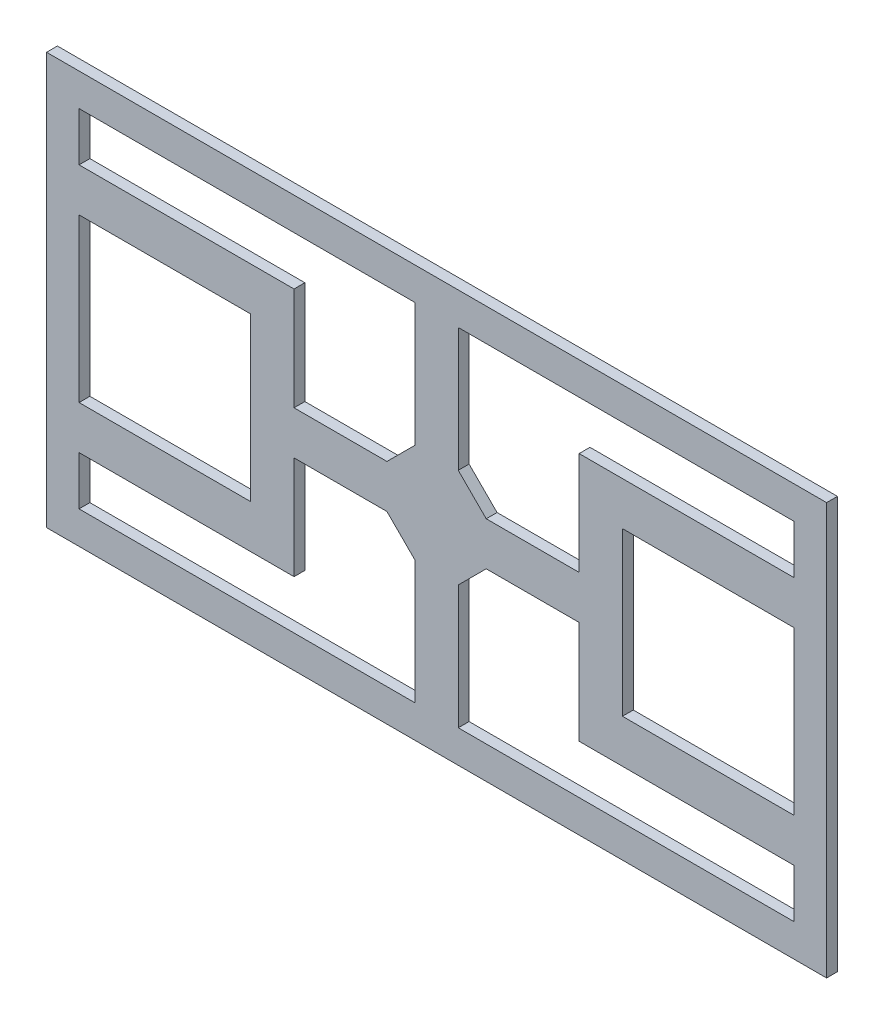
ISO-10303-21;
HEADER;
FILE_DESCRIPTION(('STEP AP214'),'2;1');
FILE_NAME('part.step','',(''),(''),'','','');
FILE_SCHEMA(('AUTOMOTIVE_DESIGN { 1 0 10303 214 1 1 1 1 }'));
ENDSEC;
DATA;
#1=APPLICATION_CONTEXT('core data for automotive mechanical design processes');
#2=APPLICATION_PROTOCOL_DEFINITION('international standard','automotive_design',2000,#1);
#3=PRODUCT_CONTEXT('',#1,'mechanical');
#4=PRODUCT('Part','Part','',(#3));
#5=PRODUCT_RELATED_PRODUCT_CATEGORY('part','',(#4));
#6=PRODUCT_DEFINITION_FORMATION('','',#4);
#7=PRODUCT_DEFINITION_CONTEXT('part definition',#1,'design');
#8=PRODUCT_DEFINITION('design','',#6,#7);
#9=PRODUCT_DEFINITION_SHAPE('','',#8);
#10=(LENGTH_UNIT() NAMED_UNIT(*) SI_UNIT(.MILLI.,.METRE.));
#11=(NAMED_UNIT(*) PLANE_ANGLE_UNIT() SI_UNIT($,.RADIAN.));
#12=(NAMED_UNIT(*) SI_UNIT($,.STERADIAN.) SOLID_ANGLE_UNIT());
#13=UNCERTAINTY_MEASURE_WITH_UNIT(LENGTH_MEASURE(1.E-05),#10,'distance_accuracy_value','');
#14=(GEOMETRIC_REPRESENTATION_CONTEXT(3) GLOBAL_UNCERTAINTY_ASSIGNED_CONTEXT((#13)) GLOBAL_UNIT_ASSIGNED_CONTEXT((#10,
#11,#12)) REPRESENTATION_CONTEXT('',''));
#15=CARTESIAN_POINT('',(0.,0.,0.));
#16=DIRECTION('',(0.,0.,1.));
#17=DIRECTION('',(1.,0.,0.));
#18=AXIS2_PLACEMENT_3D('',#15,#16,#17);
#19=CARTESIAN_POINT('',(0.,0.,12.7));
#20=DIRECTION('',(0.,0.,1.));
#21=DIRECTION('',(1.,0.,0.));
#22=AXIS2_PLACEMENT_3D('',#19,#20,#21);
#23=PLANE('',#22);
#24=DIRECTION('',(-1.,0.,0.));
#25=VECTOR('',#24,1.);
#26=CARTESIAN_POINT('',(-457.2,241.3,12.7));
#27=LINE('',#26,#25);
#28=CARTESIAN_POINT('',(457.2,241.3,12.7));
#29=VERTEX_POINT('',#28);
#30=CARTESIAN_POINT('',(-457.2,241.3,12.7));
#31=VERTEX_POINT('',#30);
#32=EDGE_CURVE('E687',#29,#31,#27,.T.);
#33=ORIENTED_EDGE('',*,*,#32,.T.);
#34=DIRECTION('',(0.,-1.,0.));
#35=VECTOR('',#34,1.);
#36=CARTESIAN_POINT('',(-457.2,-241.3,12.7));
#37=LINE('',#36,#35);
#38=CARTESIAN_POINT('',(-457.2,-241.3,12.7));
#39=VERTEX_POINT('',#38);
#40=EDGE_CURVE('E691',#31,#39,#37,.T.);
#41=ORIENTED_EDGE('',*,*,#40,.T.);
#42=DIRECTION('',(1.,0.,0.));
#43=VECTOR('',#42,1.);
#44=CARTESIAN_POINT('',(-457.2,-241.3,12.7));
#45=LINE('',#44,#43);
#46=CARTESIAN_POINT('',(457.2,-241.3,12.7));
#47=VERTEX_POINT('',#46);
#48=EDGE_CURVE('E695',#39,#47,#45,.T.);
#49=ORIENTED_EDGE('',*,*,#48,.T.);
#50=DIRECTION('',(0.,1.,0.));
#51=VECTOR('',#50,1.);
#52=CARTESIAN_POINT('',(457.2,-241.3,12.7));
#53=LINE('',#52,#51);
#54=EDGE_CURVE('E698',#47,#29,#53,.T.);
#55=ORIENTED_EDGE('',*,*,#54,.T.);
#56=EDGE_LOOP('',(#33,#41,#49,#55));
#57=FACE_BOUND('',#56,.T.);
#58=DIRECTION('',(0.,1.,0.));
#59=VECTOR('',#58,1.);
#60=CARTESIAN_POINT('',(-217.905263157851,95.25,12.7));
#61=LINE('',#60,#59);
#62=CARTESIAN_POINT('',(-217.905263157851,-95.25,12.7));
#63=VERTEX_POINT('',#62);
#64=CARTESIAN_POINT('',(-217.905263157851,95.25,12.7));
#65=VERTEX_POINT('',#64);
#66=EDGE_CURVE('E647',#63,#65,#61,.T.);
#67=ORIENTED_EDGE('',*,*,#66,.F.);
#68=DIRECTION('',(1.,0.,0.));
#69=VECTOR('',#68,1.);
#70=CARTESIAN_POINT('',(-419.099999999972,-95.25,12.7));
#71=LINE('',#70,#69);
#72=CARTESIAN_POINT('',(-419.099999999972,-95.25,12.7));
#73=VERTEX_POINT('',#72);
#74=EDGE_CURVE('E644',#73,#63,#71,.T.);
#75=ORIENTED_EDGE('',*,*,#74,.F.);
#76=DIRECTION('',(0.,-1.,0.));
#77=VECTOR('',#76,1.);
#78=CARTESIAN_POINT('',(-419.099999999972,-95.25,12.7));
#79=LINE('',#78,#77);
#80=CARTESIAN_POINT('',(-419.099999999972,95.25,12.7));
#81=VERTEX_POINT('',#80);
#82=EDGE_CURVE('E655',#81,#73,#79,.T.);
#83=ORIENTED_EDGE('',*,*,#82,.F.);
#84=DIRECTION('',(-1.,0.,0.));
#85=VECTOR('',#84,1.);
#86=CARTESIAN_POINT('',(-419.099999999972,95.25,12.7));
#87=LINE('',#86,#85);
#88=EDGE_CURVE('E651',#65,#81,#87,.T.);
#89=ORIENTED_EDGE('',*,*,#88,.F.);
#90=EDGE_LOOP('',(#67,#75,#83,#89));
#91=FACE_BOUND('',#90,.T.);
#92=DIRECTION('',(1.,0.,0.));
#93=VECTOR('',#92,1.);
#94=CARTESIAN_POINT('',(-419.099999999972,146.05,12.7));
#95=LINE('',#94,#93);
#96=CARTESIAN_POINT('',(-419.099999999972,146.05,12.7));
#97=VERTEX_POINT('',#96);
#98=CARTESIAN_POINT('',(-167.105263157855,146.05,12.7));
#99=VERTEX_POINT('',#98);
#100=EDGE_CURVE('E574',#97,#99,#95,.T.);
#101=ORIENTED_EDGE('',*,*,#100,.F.);
#102=DIRECTION('',(4.94403779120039E-13,-1.,0.));
#103=VECTOR('',#102,1.);
#104=CARTESIAN_POINT('',(-419.099999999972,146.05,12.7));
#105=LINE('',#104,#103);
#106=CARTESIAN_POINT('',(-419.1,203.2,12.7));
#107=VERTEX_POINT('',#106);
#108=EDGE_CURVE('E571',#107,#97,#105,.T.);
#109=ORIENTED_EDGE('',*,*,#108,.F.);
#110=DIRECTION('',(-1.,0.,0.));
#111=VECTOR('',#110,1.);
#112=CARTESIAN_POINT('',(-419.1,203.2,12.7));
#113=LINE('',#112,#111);
#114=CARTESIAN_POINT('',(-25.4,203.2,12.7));
#115=VERTEX_POINT('',#114);
#116=EDGE_CURVE('E591',#115,#107,#113,.T.);
#117=ORIENTED_EDGE('',*,*,#116,.F.);
#118=DIRECTION('',(0.,1.,0.));
#119=VECTOR('',#118,1.);
#120=CARTESIAN_POINT('',(-25.4,203.2,12.7));
#121=LINE('',#120,#119);
#122=CARTESIAN_POINT('',(-25.4,58.1987113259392,12.7));
#123=VERTEX_POINT('',#122);
#124=EDGE_CURVE('E587',#123,#115,#121,.T.);
#125=ORIENTED_EDGE('',*,*,#124,.F.);
#126=DIRECTION('',(0.707106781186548,0.707106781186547,0.));
#127=VECTOR('',#126,1.);
#128=CARTESIAN_POINT('',(-58.1987113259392,25.4,12.7));
#129=LINE('',#128,#127);
#130=CARTESIAN_POINT('',(-58.1987113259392,25.4,12.7));
#131=VERTEX_POINT('',#130);
#132=EDGE_CURVE('E584',#131,#123,#129,.T.);
#133=ORIENTED_EDGE('',*,*,#132,.F.);
#134=DIRECTION('',(1.,0.,0.));
#135=VECTOR('',#134,1.);
#136=CARTESIAN_POINT('',(-167.105263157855,25.4,12.7));
#137=LINE('',#136,#135);
#138=CARTESIAN_POINT('',(-167.105263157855,25.4,12.7));
#139=VERTEX_POINT('',#138);
#140=EDGE_CURVE('E581',#139,#131,#137,.T.);
#141=ORIENTED_EDGE('',*,*,#140,.F.);
#142=DIRECTION('',(0.,-1.,0.));
#143=VECTOR('',#142,1.);
#144=CARTESIAN_POINT('',(-167.105263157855,146.05,12.7));
#145=LINE('',#144,#143);
#146=EDGE_CURVE('E578',#99,#139,#145,.T.);
#147=ORIENTED_EDGE('',*,*,#146,.F.);
#148=EDGE_LOOP('',(#101,#109,#117,#125,#133,#141,#147));
#149=FACE_BOUND('',#148,.T.);
#150=DIRECTION('',(-4.94403779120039E-13,-1.,0.));
#151=VECTOR('',#150,1.);
#152=CARTESIAN_POINT('',(-419.099999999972,-146.05,12.7));
#153=LINE('',#152,#151);
#154=CARTESIAN_POINT('',(-419.099999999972,-146.05,12.7));
#155=VERTEX_POINT('',#154);
#156=CARTESIAN_POINT('',(-419.1,-203.2,12.7));
#157=VERTEX_POINT('',#156);
#158=EDGE_CURVE('E501',#155,#157,#153,.T.);
#159=ORIENTED_EDGE('',*,*,#158,.F.);
#160=DIRECTION('',(-1.,0.,0.));
#161=VECTOR('',#160,1.);
#162=CARTESIAN_POINT('',(-419.099999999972,-146.05,12.7));
#163=LINE('',#162,#161);
#164=CARTESIAN_POINT('',(-167.105263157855,-146.05,12.7));
#165=VERTEX_POINT('',#164);
#166=EDGE_CURVE('E498',#165,#155,#163,.T.);
#167=ORIENTED_EDGE('',*,*,#166,.F.);
#168=DIRECTION('',(0.,-1.,0.));
#169=VECTOR('',#168,1.);
#170=CARTESIAN_POINT('',(-167.105263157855,-146.05,12.7));
#171=LINE('',#170,#169);
#172=CARTESIAN_POINT('',(-167.105263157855,-25.4,12.7));
#173=VERTEX_POINT('',#172);
#174=EDGE_CURVE('E518',#173,#165,#171,.T.);
#175=ORIENTED_EDGE('',*,*,#174,.F.);
#176=DIRECTION('',(-1.,0.,0.));
#177=VECTOR('',#176,1.);
#178=CARTESIAN_POINT('',(-167.105263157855,-25.4,12.7));
#179=LINE('',#178,#177);
#180=CARTESIAN_POINT('',(-58.1987113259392,-25.4,12.7));
#181=VERTEX_POINT('',#180);
#182=EDGE_CURVE('E514',#181,#173,#179,.T.);
#183=ORIENTED_EDGE('',*,*,#182,.F.);
#184=DIRECTION('',(-0.707106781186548,0.707106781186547,0.));
#185=VECTOR('',#184,1.);
#186=CARTESIAN_POINT('',(-58.1987113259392,-25.4,12.7));
#187=LINE('',#186,#185);
#188=CARTESIAN_POINT('',(-25.4,-58.1987113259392,12.7));
#189=VERTEX_POINT('',#188);
#190=EDGE_CURVE('E511',#189,#181,#187,.T.);
#191=ORIENTED_EDGE('',*,*,#190,.F.);
#192=DIRECTION('',(0.,1.,0.));
#193=VECTOR('',#192,1.);
#194=CARTESIAN_POINT('',(-25.4,-203.2,12.7));
#195=LINE('',#194,#193);
#196=CARTESIAN_POINT('',(-25.4,-203.2,12.7));
#197=VERTEX_POINT('',#196);
#198=EDGE_CURVE('E508',#197,#189,#195,.T.);
#199=ORIENTED_EDGE('',*,*,#198,.F.);
#200=DIRECTION('',(1.,0.,0.));
#201=VECTOR('',#200,1.);
#202=CARTESIAN_POINT('',(-419.1,-203.2,12.7));
#203=LINE('',#202,#201);
#204=EDGE_CURVE('E505',#157,#197,#203,.T.);
#205=ORIENTED_EDGE('',*,*,#204,.F.);
#206=EDGE_LOOP('',(#159,#167,#175,#183,#191,#199,#205));
#207=FACE_BOUND('',#206,.T.);
#208=DIRECTION('',(4.94403779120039E-13,1.,0.));
#209=VECTOR('',#208,1.);
#210=CARTESIAN_POINT('',(419.099999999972,146.05,12.7));
#211=LINE('',#210,#209);
#212=CARTESIAN_POINT('',(419.099999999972,146.05,12.7));
#213=VERTEX_POINT('',#212);
#214=CARTESIAN_POINT('',(419.1,203.2,12.7));
#215=VERTEX_POINT('',#214);
#216=EDGE_CURVE('E428',#213,#215,#211,.T.);
#217=ORIENTED_EDGE('',*,*,#216,.F.);
#218=DIRECTION('',(1.,0.,0.));
#219=VECTOR('',#218,1.);
#220=CARTESIAN_POINT('',(419.099999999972,146.05,12.7));
#221=LINE('',#220,#219);
#222=CARTESIAN_POINT('',(167.105263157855,146.05,12.7));
#223=VERTEX_POINT('',#222);
#224=EDGE_CURVE('E425',#223,#213,#221,.T.);
#225=ORIENTED_EDGE('',*,*,#224,.F.);
#226=DIRECTION('',(0.,1.,0.));
#227=VECTOR('',#226,1.);
#228=CARTESIAN_POINT('',(167.105263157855,146.05,12.7));
#229=LINE('',#228,#227);
#230=CARTESIAN_POINT('',(167.105263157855,25.4,12.7));
#231=VERTEX_POINT('',#230);
#232=EDGE_CURVE('E445',#231,#223,#229,.T.);
#233=ORIENTED_EDGE('',*,*,#232,.F.);
#234=DIRECTION('',(1.,0.,0.));
#235=VECTOR('',#234,1.);
#236=CARTESIAN_POINT('',(167.105263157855,25.4,12.7));
#237=LINE('',#236,#235);
#238=CARTESIAN_POINT('',(58.1987113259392,25.4,12.7));
#239=VERTEX_POINT('',#238);
#240=EDGE_CURVE('E441',#239,#231,#237,.T.);
#241=ORIENTED_EDGE('',*,*,#240,.F.);
#242=DIRECTION('',(0.707106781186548,-0.707106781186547,0.));
#243=VECTOR('',#242,1.);
#244=CARTESIAN_POINT('',(58.1987113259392,25.4,12.7));
#245=LINE('',#244,#243);
#246=CARTESIAN_POINT('',(25.4,58.1987113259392,12.7));
#247=VERTEX_POINT('',#246);
#248=EDGE_CURVE('E438',#247,#239,#245,.T.);
#249=ORIENTED_EDGE('',*,*,#248,.F.);
#250=DIRECTION('',(0.,-1.,0.));
#251=VECTOR('',#250,1.);
#252=CARTESIAN_POINT('',(25.4,203.2,12.7));
#253=LINE('',#252,#251);
#254=CARTESIAN_POINT('',(25.4,203.2,12.7));
#255=VERTEX_POINT('',#254);
#256=EDGE_CURVE('E435',#255,#247,#253,.T.);
#257=ORIENTED_EDGE('',*,*,#256,.F.);
#258=DIRECTION('',(-1.,0.,0.));
#259=VECTOR('',#258,1.);
#260=CARTESIAN_POINT('',(419.1,203.2,12.7));
#261=LINE('',#260,#259);
#262=EDGE_CURVE('E432',#215,#255,#261,.T.);
#263=ORIENTED_EDGE('',*,*,#262,.F.);
#264=EDGE_LOOP('',(#217,#225,#233,#241,#249,#257,#263));
#265=FACE_BOUND('',#264,.T.);
#266=DIRECTION('',(0.,-1.,0.));
#267=VECTOR('',#266,1.);
#268=CARTESIAN_POINT('',(217.905263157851,95.25,12.7));
#269=LINE('',#268,#267);
#270=CARTESIAN_POINT('',(217.905263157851,95.25,12.7));
#271=VERTEX_POINT('',#270);
#272=CARTESIAN_POINT('',(217.905263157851,-95.25,12.7));
#273=VERTEX_POINT('',#272);
#274=EDGE_CURVE('E385',#271,#273,#269,.T.);
#275=ORIENTED_EDGE('',*,*,#274,.F.);
#276=DIRECTION('',(-1.,0.,0.));
#277=VECTOR('',#276,1.);
#278=CARTESIAN_POINT('',(419.099999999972,95.2499999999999,12.7));
#279=LINE('',#278,#277);
#280=CARTESIAN_POINT('',(419.099999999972,95.2499999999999,12.7));
#281=VERTEX_POINT('',#280);
#282=EDGE_CURVE('E382',#281,#271,#279,.T.);
#283=ORIENTED_EDGE('',*,*,#282,.F.);
#284=DIRECTION('',(0.,1.,0.));
#285=VECTOR('',#284,1.);
#286=CARTESIAN_POINT('',(419.099999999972,-95.2499999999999,12.7));
#287=LINE('',#286,#285);
#288=CARTESIAN_POINT('',(419.099999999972,-95.2499999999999,12.7));
#289=VERTEX_POINT('',#288);
#290=EDGE_CURVE('E393',#289,#281,#287,.T.);
#291=ORIENTED_EDGE('',*,*,#290,.F.);
#292=DIRECTION('',(1.,0.,0.));
#293=VECTOR('',#292,1.);
#294=CARTESIAN_POINT('',(419.099999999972,-95.2499999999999,12.7));
#295=LINE('',#294,#293);
#296=EDGE_CURVE('E389',#273,#289,#295,.T.);
#297=ORIENTED_EDGE('',*,*,#296,.F.);
#298=EDGE_LOOP('',(#275,#283,#291,#297));
#299=FACE_BOUND('',#298,.T.);
#300=DIRECTION('',(-4.94403779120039E-13,1.,0.));
#301=VECTOR('',#300,1.);
#302=CARTESIAN_POINT('',(419.099999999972,-146.05,12.7));
#303=LINE('',#302,#301);
#304=CARTESIAN_POINT('',(419.1,-203.2,12.7));
#305=VERTEX_POINT('',#304);
#306=CARTESIAN_POINT('',(419.099999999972,-146.05,12.7));
#307=VERTEX_POINT('',#306);
#308=EDGE_CURVE('E312',#305,#307,#303,.T.);
#309=ORIENTED_EDGE('',*,*,#308,.F.);
#310=DIRECTION('',(1.,0.,0.));
#311=VECTOR('',#310,1.);
#312=CARTESIAN_POINT('',(419.1,-203.2,12.7));
#313=LINE('',#312,#311);
#314=CARTESIAN_POINT('',(25.4,-203.2,12.7));
#315=VERTEX_POINT('',#314);
#316=EDGE_CURVE('E303',#315,#305,#313,.T.);
#317=ORIENTED_EDGE('',*,*,#316,.F.);
#318=DIRECTION('',(0.,-1.,0.));
#319=VECTOR('',#318,1.);
#320=CARTESIAN_POINT('',(25.4,-203.2,12.7));
#321=LINE('',#320,#319);
#322=CARTESIAN_POINT('',(25.4,-58.1987113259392,12.7));
#323=VERTEX_POINT('',#322);
#324=EDGE_CURVE('E341',#323,#315,#321,.T.);
#325=ORIENTED_EDGE('',*,*,#324,.F.);
#326=DIRECTION('',(-0.707106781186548,-0.707106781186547,0.));
#327=VECTOR('',#326,1.);
#328=CARTESIAN_POINT('',(58.1987113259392,-25.4,12.7));
#329=LINE('',#328,#327);
#330=CARTESIAN_POINT('',(58.1987113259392,-25.4,12.7));
#331=VERTEX_POINT('',#330);
#332=EDGE_CURVE('E338',#331,#323,#329,.T.);
#333=ORIENTED_EDGE('',*,*,#332,.F.);
#334=DIRECTION('',(-1.,0.,0.));
#335=VECTOR('',#334,1.);
#336=CARTESIAN_POINT('',(167.105263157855,-25.4,12.7));
#337=LINE('',#336,#335);
#338=CARTESIAN_POINT('',(167.105263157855,-25.4,12.7));
#339=VERTEX_POINT('',#338);
#340=EDGE_CURVE('E335',#339,#331,#337,.T.);
#341=ORIENTED_EDGE('',*,*,#340,.F.);
#342=DIRECTION('',(0.,1.,0.));
#343=VECTOR('',#342,1.);
#344=CARTESIAN_POINT('',(167.105263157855,-146.05,12.7));
#345=LINE('',#344,#343);
#346=CARTESIAN_POINT('',(167.105263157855,-146.05,12.7));
#347=VERTEX_POINT('',#346);
#348=EDGE_CURVE('E330',#347,#339,#345,.T.);
#349=ORIENTED_EDGE('',*,*,#348,.F.);
#350=DIRECTION('',(-1.,0.,0.));
#351=VECTOR('',#350,1.);
#352=CARTESIAN_POINT('',(419.099999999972,-146.05,12.7));
#353=LINE('',#352,#351);
#354=EDGE_CURVE('E326',#307,#347,#353,.T.);
#355=ORIENTED_EDGE('',*,*,#354,.F.);
#356=EDGE_LOOP('',(#309,#317,#325,#333,#341,#349,#355));
#357=FACE_BOUND('',#356,.T.);
#358=ADVANCED_FACE('F45',(#57,#91,#149,#207,#265,#299,#357),#23,.T.);
#359=CARTESIAN_POINT('',(0.,0.,0.));
#360=DIRECTION('',(0.,0.,1.));
#361=DIRECTION('',(1.,0.,0.));
#362=AXIS2_PLACEMENT_3D('',#359,#360,#361);
#363=PLANE('',#362);
#364=DIRECTION('',(-1.,0.,0.));
#365=VECTOR('',#364,1.);
#366=CARTESIAN_POINT('',(419.099999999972,95.2499999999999,0.));
#367=LINE('',#366,#365);
#368=CARTESIAN_POINT('',(419.099999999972,95.2499999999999,0.));
#369=VERTEX_POINT('',#368);
#370=CARTESIAN_POINT('',(217.905263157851,95.25,0.));
#371=VERTEX_POINT('',#370);
#372=EDGE_CURVE('E321',#369,#371,#367,.T.);
#373=ORIENTED_EDGE('',*,*,#372,.T.);
#374=DIRECTION('',(0.,-1.,0.));
#375=VECTOR('',#374,1.);
#376=CARTESIAN_POINT('',(217.905263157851,95.25,0.));
#377=LINE('',#376,#375);
#378=CARTESIAN_POINT('',(217.905263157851,-95.25,0.));
#379=VERTEX_POINT('',#378);
#380=EDGE_CURVE('E400',#371,#379,#377,.T.);
#381=ORIENTED_EDGE('',*,*,#380,.T.);
#382=DIRECTION('',(1.,0.,0.));
#383=VECTOR('',#382,1.);
#384=CARTESIAN_POINT('',(419.099999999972,-95.2499999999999,0.));
#385=LINE('',#384,#383);
#386=CARTESIAN_POINT('',(419.099999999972,-95.2499999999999,0.));
#387=VERTEX_POINT('',#386);
#388=EDGE_CURVE('E404',#379,#387,#385,.T.);
#389=ORIENTED_EDGE('',*,*,#388,.T.);
#390=DIRECTION('',(0.,1.,0.));
#391=VECTOR('',#390,1.);
#392=CARTESIAN_POINT('',(419.099999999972,-95.2499999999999,0.));
#393=LINE('',#392,#391);
#394=EDGE_CURVE('E386',#387,#369,#393,.T.);
#395=ORIENTED_EDGE('',*,*,#394,.T.);
#396=EDGE_LOOP('',(#373,#381,#389,#395));
#397=FACE_BOUND('',#396,.T.);
#398=DIRECTION('',(-1.,0.,0.));
#399=VECTOR('',#398,1.);
#400=CARTESIAN_POINT('',(-419.099999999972,-146.05,0.));
#401=LINE('',#400,#399);
#402=CARTESIAN_POINT('',(-167.105263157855,-146.05,0.));
#403=VERTEX_POINT('',#402);
#404=CARTESIAN_POINT('',(-419.099999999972,-146.05,0.));
#405=VERTEX_POINT('',#404);
#406=EDGE_CURVE('E497',#403,#405,#401,.T.);
#407=ORIENTED_EDGE('',*,*,#406,.T.);
#408=DIRECTION('',(-4.94403779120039E-13,-1.,0.));
#409=VECTOR('',#408,1.);
#410=CARTESIAN_POINT('',(-419.099999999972,-146.05,0.));
#411=LINE('',#410,#409);
#412=CARTESIAN_POINT('',(-419.1,-203.2,0.));
#413=VERTEX_POINT('',#412);
#414=EDGE_CURVE('E525',#405,#413,#411,.T.);
#415=ORIENTED_EDGE('',*,*,#414,.T.);
#416=DIRECTION('',(1.,0.,0.));
#417=VECTOR('',#416,1.);
#418=CARTESIAN_POINT('',(-419.1,-203.2,0.));
#419=LINE('',#418,#417);
#420=CARTESIAN_POINT('',(-25.4,-203.2,0.));
#421=VERTEX_POINT('',#420);
#422=EDGE_CURVE('E529',#413,#421,#419,.T.);
#423=ORIENTED_EDGE('',*,*,#422,.T.);
#424=DIRECTION('',(0.,1.,0.));
#425=VECTOR('',#424,1.);
#426=CARTESIAN_POINT('',(-25.4,-203.2,0.));
#427=LINE('',#426,#425);
#428=CARTESIAN_POINT('',(-25.4,-58.1987113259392,0.));
#429=VERTEX_POINT('',#428);
#430=EDGE_CURVE('E533',#421,#429,#427,.T.);
#431=ORIENTED_EDGE('',*,*,#430,.T.);
#432=DIRECTION('',(-0.707106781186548,0.707106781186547,0.));
#433=VECTOR('',#432,1.);
#434=CARTESIAN_POINT('',(-58.1987113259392,-25.4,0.));
#435=LINE('',#434,#433);
#436=CARTESIAN_POINT('',(-58.1987113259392,-25.4,0.));
#437=VERTEX_POINT('',#436);
#438=EDGE_CURVE('E537',#429,#437,#435,.T.);
#439=ORIENTED_EDGE('',*,*,#438,.T.);
#440=DIRECTION('',(-1.,0.,0.));
#441=VECTOR('',#440,1.);
#442=CARTESIAN_POINT('',(-167.105263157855,-25.4,0.));
#443=LINE('',#442,#441);
#444=CARTESIAN_POINT('',(-167.105263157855,-25.4,0.));
#445=VERTEX_POINT('',#444);
#446=EDGE_CURVE('E541',#437,#445,#443,.T.);
#447=ORIENTED_EDGE('',*,*,#446,.T.);
#448=DIRECTION('',(0.,-1.,0.));
#449=VECTOR('',#448,1.);
#450=CARTESIAN_POINT('',(-167.105263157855,-146.05,0.));
#451=LINE('',#450,#449);
#452=EDGE_CURVE('E502',#445,#403,#451,.T.);
#453=ORIENTED_EDGE('',*,*,#452,.T.);
#454=EDGE_LOOP('',(#407,#415,#423,#431,#439,#447,#453));
#455=FACE_BOUND('',#454,.T.);
#456=DIRECTION('',(1.,0.,0.));
#457=VECTOR('',#456,1.);
#458=CARTESIAN_POINT('',(-419.099999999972,-95.25,0.));
#459=LINE('',#458,#457);
#460=CARTESIAN_POINT('',(-419.099999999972,-95.25,0.));
#461=VERTEX_POINT('',#460);
#462=CARTESIAN_POINT('',(-217.905263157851,-95.25,0.));
#463=VERTEX_POINT('',#462);
#464=EDGE_CURVE('E643',#461,#463,#459,.T.);
#465=ORIENTED_EDGE('',*,*,#464,.T.);
#466=DIRECTION('',(0.,1.,0.));
#467=VECTOR('',#466,1.);
#468=CARTESIAN_POINT('',(-217.905263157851,95.25,0.));
#469=LINE('',#468,#467);
#470=CARTESIAN_POINT('',(-217.905263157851,95.25,0.));
#471=VERTEX_POINT('',#470);
#472=EDGE_CURVE('E662',#463,#471,#469,.T.);
#473=ORIENTED_EDGE('',*,*,#472,.T.);
#474=DIRECTION('',(-1.,0.,0.));
#475=VECTOR('',#474,1.);
#476=CARTESIAN_POINT('',(-419.099999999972,95.25,0.));
#477=LINE('',#476,#475);
#478=CARTESIAN_POINT('',(-419.099999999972,95.25,0.));
#479=VERTEX_POINT('',#478);
#480=EDGE_CURVE('E666',#471,#479,#477,.T.);
#481=ORIENTED_EDGE('',*,*,#480,.T.);
#482=DIRECTION('',(0.,-1.,0.));
#483=VECTOR('',#482,1.);
#484=CARTESIAN_POINT('',(-419.099999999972,-95.25,0.));
#485=LINE('',#484,#483);
#486=EDGE_CURVE('E648',#479,#461,#485,.T.);
#487=ORIENTED_EDGE('',*,*,#486,.T.);
#488=EDGE_LOOP('',(#465,#473,#481,#487));
#489=FACE_BOUND('',#488,.T.);
#490=DIRECTION('',(-1.,0.,0.));
#491=VECTOR('',#490,1.);
#492=CARTESIAN_POINT('',(-457.2,241.3,0.));
#493=LINE('',#492,#491);
#494=CARTESIAN_POINT('',(457.2,241.3,0.));
#495=VERTEX_POINT('',#494);
#496=CARTESIAN_POINT('',(-457.2,241.3,0.));
#497=VERTEX_POINT('',#496);
#498=EDGE_CURVE('E686',#495,#497,#493,.T.);
#499=ORIENTED_EDGE('',*,*,#498,.F.);
#500=DIRECTION('',(0.,1.,0.));
#501=VECTOR('',#500,1.);
#502=CARTESIAN_POINT('',(457.2,-241.3,0.));
#503=LINE('',#502,#501);
#504=CARTESIAN_POINT('',(457.2,-241.3,0.));
#505=VERTEX_POINT('',#504);
#506=EDGE_CURVE('E692',#505,#495,#503,.T.);
#507=ORIENTED_EDGE('',*,*,#506,.F.);
#508=DIRECTION('',(1.,0.,0.));
#509=VECTOR('',#508,1.);
#510=CARTESIAN_POINT('',(-457.2,-241.3,0.));
#511=LINE('',#510,#509);
#512=CARTESIAN_POINT('',(-457.2,-241.3,0.));
#513=VERTEX_POINT('',#512);
#514=EDGE_CURVE('E708',#513,#505,#511,.T.);
#515=ORIENTED_EDGE('',*,*,#514,.F.);
#516=DIRECTION('',(0.,-1.,0.));
#517=VECTOR('',#516,1.);
#518=CARTESIAN_POINT('',(-457.2,-241.3,0.));
#519=LINE('',#518,#517);
#520=EDGE_CURVE('E705',#497,#513,#519,.T.);
#521=ORIENTED_EDGE('',*,*,#520,.F.);
#522=EDGE_LOOP('',(#499,#507,#515,#521));
#523=FACE_BOUND('',#522,.T.);
#524=DIRECTION('',(4.94403779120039E-13,-1.,0.));
#525=VECTOR('',#524,1.);
#526=CARTESIAN_POINT('',(-419.099999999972,146.05,0.));
#527=LINE('',#526,#525);
#528=CARTESIAN_POINT('',(-419.1,203.2,0.));
#529=VERTEX_POINT('',#528);
#530=CARTESIAN_POINT('',(-419.099999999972,146.05,0.));
#531=VERTEX_POINT('',#530);
#532=EDGE_CURVE('E570',#529,#531,#527,.T.);
#533=ORIENTED_EDGE('',*,*,#532,.T.);
#534=DIRECTION('',(1.,0.,0.));
#535=VECTOR('',#534,1.);
#536=CARTESIAN_POINT('',(-419.099999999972,146.05,0.));
#537=LINE('',#536,#535);
#538=CARTESIAN_POINT('',(-167.105263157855,146.05,0.));
#539=VERTEX_POINT('',#538);
#540=EDGE_CURVE('E598',#531,#539,#537,.T.);
#541=ORIENTED_EDGE('',*,*,#540,.T.);
#542=DIRECTION('',(0.,-1.,0.));
#543=VECTOR('',#542,1.);
#544=CARTESIAN_POINT('',(-167.105263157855,146.05,0.));
#545=LINE('',#544,#543);
#546=CARTESIAN_POINT('',(-167.105263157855,25.4,0.));
#547=VERTEX_POINT('',#546);
#548=EDGE_CURVE('E602',#539,#547,#545,.T.);
#549=ORIENTED_EDGE('',*,*,#548,.T.);
#550=DIRECTION('',(1.,0.,0.));
#551=VECTOR('',#550,1.);
#552=CARTESIAN_POINT('',(-167.105263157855,25.4,0.));
#553=LINE('',#552,#551);
#554=CARTESIAN_POINT('',(-58.1987113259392,25.4,0.));
#555=VERTEX_POINT('',#554);
#556=EDGE_CURVE('E606',#547,#555,#553,.T.);
#557=ORIENTED_EDGE('',*,*,#556,.T.);
#558=DIRECTION('',(0.707106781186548,0.707106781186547,0.));
#559=VECTOR('',#558,1.);
#560=CARTESIAN_POINT('',(-58.1987113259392,25.4,0.));
#561=LINE('',#560,#559);
#562=CARTESIAN_POINT('',(-25.4,58.1987113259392,0.));
#563=VERTEX_POINT('',#562);
#564=EDGE_CURVE('E610',#555,#563,#561,.T.);
#565=ORIENTED_EDGE('',*,*,#564,.T.);
#566=DIRECTION('',(0.,1.,0.));
#567=VECTOR('',#566,1.);
#568=CARTESIAN_POINT('',(-25.4,203.2,0.));
#569=LINE('',#568,#567);
#570=CARTESIAN_POINT('',(-25.4,203.2,0.));
#571=VERTEX_POINT('',#570);
#572=EDGE_CURVE('E614',#563,#571,#569,.T.);
#573=ORIENTED_EDGE('',*,*,#572,.T.);
#574=DIRECTION('',(-1.,0.,0.));
#575=VECTOR('',#574,1.);
#576=CARTESIAN_POINT('',(-419.1,203.2,0.));
#577=LINE('',#576,#575);
#578=EDGE_CURVE('E575',#571,#529,#577,.T.);
#579=ORIENTED_EDGE('',*,*,#578,.T.);
#580=EDGE_LOOP('',(#533,#541,#549,#557,#565,#573,#579));
#581=FACE_BOUND('',#580,.T.);
#582=DIRECTION('',(1.,0.,0.));
#583=VECTOR('',#582,1.);
#584=CARTESIAN_POINT('',(419.099999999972,146.05,0.));
#585=LINE('',#584,#583);
#586=CARTESIAN_POINT('',(167.105263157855,146.05,0.));
#587=VERTEX_POINT('',#586);
#588=CARTESIAN_POINT('',(419.099999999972,146.05,0.));
#589=VERTEX_POINT('',#588);
#590=EDGE_CURVE('E424',#587,#589,#585,.T.);
#591=ORIENTED_EDGE('',*,*,#590,.T.);
#592=DIRECTION('',(4.94403779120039E-13,1.,0.));
#593=VECTOR('',#592,1.);
#594=CARTESIAN_POINT('',(419.099999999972,146.05,0.));
#595=LINE('',#594,#593);
#596=CARTESIAN_POINT('',(419.1,203.2,0.));
#597=VERTEX_POINT('',#596);
#598=EDGE_CURVE('E452',#589,#597,#595,.T.);
#599=ORIENTED_EDGE('',*,*,#598,.T.);
#600=DIRECTION('',(-1.,0.,0.));
#601=VECTOR('',#600,1.);
#602=CARTESIAN_POINT('',(419.1,203.2,0.));
#603=LINE('',#602,#601);
#604=CARTESIAN_POINT('',(25.4,203.2,0.));
#605=VERTEX_POINT('',#604);
#606=EDGE_CURVE('E456',#597,#605,#603,.T.);
#607=ORIENTED_EDGE('',*,*,#606,.T.);
#608=DIRECTION('',(0.,-1.,0.));
#609=VECTOR('',#608,1.);
#610=CARTESIAN_POINT('',(25.4,203.2,0.));
#611=LINE('',#610,#609);
#612=CARTESIAN_POINT('',(25.4,58.1987113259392,0.));
#613=VERTEX_POINT('',#612);
#614=EDGE_CURVE('E460',#605,#613,#611,.T.);
#615=ORIENTED_EDGE('',*,*,#614,.T.);
#616=DIRECTION('',(0.707106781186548,-0.707106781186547,0.));
#617=VECTOR('',#616,1.);
#618=CARTESIAN_POINT('',(58.1987113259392,25.4,0.));
#619=LINE('',#618,#617);
#620=CARTESIAN_POINT('',(58.1987113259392,25.4,0.));
#621=VERTEX_POINT('',#620);
#622=EDGE_CURVE('E464',#613,#621,#619,.T.);
#623=ORIENTED_EDGE('',*,*,#622,.T.);
#624=DIRECTION('',(1.,0.,0.));
#625=VECTOR('',#624,1.);
#626=CARTESIAN_POINT('',(167.105263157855,25.4,0.));
#627=LINE('',#626,#625);
#628=CARTESIAN_POINT('',(167.105263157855,25.4,0.));
#629=VERTEX_POINT('',#628);
#630=EDGE_CURVE('E468',#621,#629,#627,.T.);
#631=ORIENTED_EDGE('',*,*,#630,.T.);
#632=DIRECTION('',(0.,1.,0.));
#633=VECTOR('',#632,1.);
#634=CARTESIAN_POINT('',(167.105263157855,146.05,0.));
#635=LINE('',#634,#633);
#636=EDGE_CURVE('E429',#629,#587,#635,.T.);
#637=ORIENTED_EDGE('',*,*,#636,.T.);
#638=EDGE_LOOP('',(#591,#599,#607,#615,#623,#631,#637));
#639=FACE_BOUND('',#638,.T.);
#640=DIRECTION('',(1.,0.,0.));
#641=VECTOR('',#640,1.);
#642=CARTESIAN_POINT('',(419.1,-203.2,0.));
#643=LINE('',#642,#641);
#644=CARTESIAN_POINT('',(25.4,-203.2,0.));
#645=VERTEX_POINT('',#644);
#646=CARTESIAN_POINT('',(419.1,-203.2,0.));
#647=VERTEX_POINT('',#646);
#648=EDGE_CURVE('E69',#645,#647,#643,.T.);
#649=ORIENTED_EDGE('',*,*,#648,.T.);
#650=DIRECTION('',(-4.94403779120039E-13,1.,0.));
#651=VECTOR('',#650,1.);
#652=CARTESIAN_POINT('',(419.099999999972,-146.05,0.));
#653=LINE('',#652,#651);
#654=CARTESIAN_POINT('',(419.099999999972,-146.05,0.));
#655=VERTEX_POINT('',#654);
#656=EDGE_CURVE('E319',#647,#655,#653,.T.);
#657=ORIENTED_EDGE('',*,*,#656,.T.);
#658=DIRECTION('',(-1.,0.,0.));
#659=VECTOR('',#658,1.);
#660=CARTESIAN_POINT('',(419.099999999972,-146.05,0.));
#661=LINE('',#660,#659);
#662=CARTESIAN_POINT('',(167.105263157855,-146.05,0.));
#663=VERTEX_POINT('',#662);
#664=EDGE_CURVE('E348',#655,#663,#661,.T.);
#665=ORIENTED_EDGE('',*,*,#664,.T.);
#666=DIRECTION('',(0.,1.,0.));
#667=VECTOR('',#666,1.);
#668=CARTESIAN_POINT('',(167.105263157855,-146.05,0.));
#669=LINE('',#668,#667);
#670=CARTESIAN_POINT('',(167.105263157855,-25.4,0.));
#671=VERTEX_POINT('',#670);
#672=EDGE_CURVE('E352',#663,#671,#669,.T.);
#673=ORIENTED_EDGE('',*,*,#672,.T.);
#674=DIRECTION('',(-1.,0.,0.));
#675=VECTOR('',#674,1.);
#676=CARTESIAN_POINT('',(167.105263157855,-25.4,0.));
#677=LINE('',#676,#675);
#678=CARTESIAN_POINT('',(58.1987113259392,-25.4,0.));
#679=VERTEX_POINT('',#678);
#680=EDGE_CURVE('E356',#671,#679,#677,.T.);
#681=ORIENTED_EDGE('',*,*,#680,.T.);
#682=DIRECTION('',(-0.707106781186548,-0.707106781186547,0.));
#683=VECTOR('',#682,1.);
#684=CARTESIAN_POINT('',(58.1987113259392,-25.4,0.));
#685=LINE('',#684,#683);
#686=CARTESIAN_POINT('',(25.4,-58.1987113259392,0.));
#687=VERTEX_POINT('',#686);
#688=EDGE_CURVE('E360',#679,#687,#685,.T.);
#689=ORIENTED_EDGE('',*,*,#688,.T.);
#690=DIRECTION('',(0.,-1.,0.));
#691=VECTOR('',#690,1.);
#692=CARTESIAN_POINT('',(25.4,-203.2,0.));
#693=LINE('',#692,#691);
#694=EDGE_CURVE('E313',#687,#645,#693,.T.);
#695=ORIENTED_EDGE('',*,*,#694,.T.);
#696=EDGE_LOOP('',(#649,#657,#665,#673,#681,#689,#695));
#697=FACE_BOUND('',#696,.T.);
#698=ADVANCED_FACE('F731',(#397,#455,#489,#523,#581,#639,#697),#363,.F.);
#699=CARTESIAN_POINT('',(-457.2,241.3,12.7));
#700=DIRECTION('',(0.,-1.,0.));
#701=DIRECTION('',(0.,0.,-1.));
#702=AXIS2_PLACEMENT_3D('',#699,#700,#701);
#703=PLANE('',#702);
#704=ORIENTED_EDGE('',*,*,#498,.T.);
#705=DIRECTION('',(0.,0.,-1.));
#706=VECTOR('',#705,1.);
#707=CARTESIAN_POINT('',(-457.2,241.3,12.7));
#708=LINE('',#707,#706);
#709=EDGE_CURVE('E11',#31,#497,#708,.T.);
#710=ORIENTED_EDGE('',*,*,#709,.F.);
#711=ORIENTED_EDGE('',*,*,#32,.F.);
#712=DIRECTION('',(0.,0.,-1.));
#713=VECTOR('',#712,1.);
#714=CARTESIAN_POINT('',(457.2,241.3,12.7));
#715=LINE('',#714,#713);
#716=EDGE_CURVE('E701',#29,#495,#715,.T.);
#717=ORIENTED_EDGE('',*,*,#716,.T.);
#718=EDGE_LOOP('',(#704,#710,#711,#717));
#719=FACE_BOUND('',#718,.T.);
#720=ADVANCED_FACE('F47',(#719),#703,.F.);
#721=CARTESIAN_POINT('',(-457.2,-241.3,12.7));
#722=DIRECTION('',(1.,0.,0.));
#723=DIRECTION('',(0.,0.,-1.));
#724=AXIS2_PLACEMENT_3D('',#721,#722,#723);
#725=PLANE('',#724);
#726=ORIENTED_EDGE('',*,*,#520,.T.);
#727=DIRECTION('',(0.,0.,-1.));
#728=VECTOR('',#727,1.);
#729=CARTESIAN_POINT('',(-457.2,-241.3,12.7));
#730=LINE('',#729,#728);
#731=EDGE_CURVE('E54',#39,#513,#730,.T.);
#732=ORIENTED_EDGE('',*,*,#731,.F.);
#733=ORIENTED_EDGE('',*,*,#40,.F.);
#734=ORIENTED_EDGE('',*,*,#709,.T.);
#735=EDGE_LOOP('',(#726,#732,#733,#734));
#736=FACE_BOUND('',#735,.T.);
#737=ADVANCED_FACE('F742',(#736),#725,.F.);
#738=CARTESIAN_POINT('',(-457.2,-241.3,12.7));
#739=DIRECTION('',(0.,1.,0.));
#740=DIRECTION('',(0.,0.,1.));
#741=AXIS2_PLACEMENT_3D('',#738,#739,#740);
#742=PLANE('',#741);
#743=ORIENTED_EDGE('',*,*,#514,.T.);
#744=DIRECTION('',(0.,0.,-1.));
#745=VECTOR('',#744,1.);
#746=CARTESIAN_POINT('',(457.2,-241.3,12.7));
#747=LINE('',#746,#745);
#748=EDGE_CURVE('E716',#47,#505,#747,.T.);
#749=ORIENTED_EDGE('',*,*,#748,.F.);
#750=ORIENTED_EDGE('',*,*,#48,.F.);
#751=ORIENTED_EDGE('',*,*,#731,.T.);
#752=EDGE_LOOP('',(#743,#749,#750,#751));
#753=FACE_BOUND('',#752,.T.);
#754=ADVANCED_FACE('F725',(#753),#742,.F.);
#755=CARTESIAN_POINT('',(457.2,-241.3,12.7));
#756=DIRECTION('',(-1.,0.,0.));
#757=DIRECTION('',(0.,0.,1.));
#758=AXIS2_PLACEMENT_3D('',#755,#756,#757);
#759=PLANE('',#758);
#760=ORIENTED_EDGE('',*,*,#506,.T.);
#761=ORIENTED_EDGE('',*,*,#716,.F.);
#762=ORIENTED_EDGE('',*,*,#54,.F.);
#763=ORIENTED_EDGE('',*,*,#748,.T.);
#764=EDGE_LOOP('',(#760,#761,#762,#763));
#765=FACE_BOUND('',#764,.T.);
#766=ADVANCED_FACE('F735',(#765),#759,.F.);
#767=CARTESIAN_POINT('',(-419.099999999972,-95.25,12.7));
#768=DIRECTION('',(0.,1.,0.));
#769=DIRECTION('',(0.,0.,1.));
#770=AXIS2_PLACEMENT_3D('',#767,#768,#769);
#771=PLANE('',#770);
#772=ORIENTED_EDGE('',*,*,#464,.F.);
#773=DIRECTION('',(0.,0.,-1.));
#774=VECTOR('',#773,1.);
#775=CARTESIAN_POINT('',(-419.099999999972,-95.25,12.7));
#776=LINE('',#775,#774);
#777=EDGE_CURVE('E658',#73,#461,#776,.T.);
#778=ORIENTED_EDGE('',*,*,#777,.F.);
#779=ORIENTED_EDGE('',*,*,#74,.T.);
#780=DIRECTION('',(0.,0.,-1.));
#781=VECTOR('',#780,1.);
#782=CARTESIAN_POINT('',(-217.905263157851,-95.25,12.7));
#783=LINE('',#782,#781);
#784=EDGE_CURVE('E682',#63,#463,#783,.T.);
#785=ORIENTED_EDGE('',*,*,#784,.T.);
#786=EDGE_LOOP('',(#772,#778,#779,#785));
#787=FACE_BOUND('',#786,.T.);
#788=ADVANCED_FACE('F757',(#787),#771,.T.);
#789=CARTESIAN_POINT('',(-217.905263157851,95.25,12.7));
#790=DIRECTION('',(-1.,0.,0.));
#791=DIRECTION('',(0.,0.,1.));
#792=AXIS2_PLACEMENT_3D('',#789,#790,#791);
#793=PLANE('',#792);
#794=ORIENTED_EDGE('',*,*,#472,.F.);
#795=ORIENTED_EDGE('',*,*,#784,.F.);
#796=ORIENTED_EDGE('',*,*,#66,.T.);
#797=DIRECTION('',(0.,0.,-1.));
#798=VECTOR('',#797,1.);
#799=CARTESIAN_POINT('',(-217.905263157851,95.25,12.7));
#800=LINE('',#799,#798);
#801=EDGE_CURVE('E679',#65,#471,#800,.T.);
#802=ORIENTED_EDGE('',*,*,#801,.T.);
#803=EDGE_LOOP('',(#794,#795,#796,#802));
#804=FACE_BOUND('',#803,.T.);
#805=ADVANCED_FACE('F764',(#804),#793,.T.);
#806=CARTESIAN_POINT('',(-419.099999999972,95.25,12.7));
#807=DIRECTION('',(0.,-1.,0.));
#808=DIRECTION('',(0.,0.,-1.));
#809=AXIS2_PLACEMENT_3D('',#806,#807,#808);
#810=PLANE('',#809);
#811=ORIENTED_EDGE('',*,*,#480,.F.);
#812=ORIENTED_EDGE('',*,*,#801,.F.);
#813=ORIENTED_EDGE('',*,*,#88,.T.);
#814=DIRECTION('',(0.,0.,-1.));
#815=VECTOR('',#814,1.);
#816=CARTESIAN_POINT('',(-419.099999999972,95.25,12.7));
#817=LINE('',#816,#815);
#818=EDGE_CURVE('E676',#81,#479,#817,.T.);
#819=ORIENTED_EDGE('',*,*,#818,.T.);
#820=EDGE_LOOP('',(#811,#812,#813,#819));
#821=FACE_BOUND('',#820,.T.);
#822=ADVANCED_FACE('F769',(#821),#810,.T.);
#823=CARTESIAN_POINT('',(-419.099999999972,-95.25,12.7));
#824=DIRECTION('',(1.,0.,0.));
#825=DIRECTION('',(0.,0.,-1.));
#826=AXIS2_PLACEMENT_3D('',#823,#824,#825);
#827=PLANE('',#826);
#828=ORIENTED_EDGE('',*,*,#486,.F.);
#829=ORIENTED_EDGE('',*,*,#818,.F.);
#830=ORIENTED_EDGE('',*,*,#82,.T.);
#831=ORIENTED_EDGE('',*,*,#777,.T.);
#832=EDGE_LOOP('',(#828,#829,#830,#831));
#833=FACE_BOUND('',#832,.T.);
#834=ADVANCED_FACE('F777',(#833),#827,.T.);
#835=CARTESIAN_POINT('',(-419.099999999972,146.05,12.7));
#836=DIRECTION('',(1.,4.94403779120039E-13,0.));
#837=DIRECTION('',(-4.94403779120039E-13,1.,0.));
#838=AXIS2_PLACEMENT_3D('',#835,#836,#837);
#839=PLANE('',#838);
#840=ORIENTED_EDGE('',*,*,#532,.F.);
#841=DIRECTION('',(0.,0.,-1.));
#842=VECTOR('',#841,1.);
#843=CARTESIAN_POINT('',(-419.1,203.2,12.7));
#844=LINE('',#843,#842);
#845=EDGE_CURVE('E594',#107,#529,#844,.T.);
#846=ORIENTED_EDGE('',*,*,#845,.F.);
#847=ORIENTED_EDGE('',*,*,#108,.T.);
#848=DIRECTION('',(0.,0.,-1.));
#849=VECTOR('',#848,1.);
#850=CARTESIAN_POINT('',(-419.099999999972,146.05,12.7));
#851=LINE('',#850,#849);
#852=EDGE_CURVE('E639',#97,#531,#851,.T.);
#853=ORIENTED_EDGE('',*,*,#852,.T.);
#854=EDGE_LOOP('',(#840,#846,#847,#853));
#855=FACE_BOUND('',#854,.T.);
#856=ADVANCED_FACE('F908',(#855),#839,.T.);
#857=CARTESIAN_POINT('',(-419.099999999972,146.05,12.7));
#858=DIRECTION('',(0.,1.,0.));
#859=DIRECTION('',(0.,0.,1.));
#860=AXIS2_PLACEMENT_3D('',#857,#858,#859);
#861=PLANE('',#860);
#862=ORIENTED_EDGE('',*,*,#540,.F.);
#863=ORIENTED_EDGE('',*,*,#852,.F.);
#864=ORIENTED_EDGE('',*,*,#100,.T.);
#865=DIRECTION('',(0.,0.,-1.));
#866=VECTOR('',#865,1.);
#867=CARTESIAN_POINT('',(-167.105263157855,146.05,12.7));
#868=LINE('',#867,#866);
#869=EDGE_CURVE('E636',#99,#539,#868,.T.);
#870=ORIENTED_EDGE('',*,*,#869,.T.);
#871=EDGE_LOOP('',(#862,#863,#864,#870));
#872=FACE_BOUND('',#871,.T.);
#873=ADVANCED_FACE('F904',(#872),#861,.T.);
#874=CARTESIAN_POINT('',(-167.105263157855,146.05,12.7));
#875=DIRECTION('',(1.,0.,0.));
#876=DIRECTION('',(0.,0.,-1.));
#877=AXIS2_PLACEMENT_3D('',#874,#875,#876);
#878=PLANE('',#877);
#879=ORIENTED_EDGE('',*,*,#548,.F.);
#880=ORIENTED_EDGE('',*,*,#869,.F.);
#881=ORIENTED_EDGE('',*,*,#146,.T.);
#882=DIRECTION('',(0.,0.,-1.));
#883=VECTOR('',#882,1.);
#884=CARTESIAN_POINT('',(-167.105263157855,25.4,12.7));
#885=LINE('',#884,#883);
#886=EDGE_CURVE('E633',#139,#547,#885,.T.);
#887=ORIENTED_EDGE('',*,*,#886,.T.);
#888=EDGE_LOOP('',(#879,#880,#881,#887));
#889=FACE_BOUND('',#888,.T.);
#890=ADVANCED_FACE('F900',(#889),#878,.T.);
#891=CARTESIAN_POINT('',(-167.105263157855,25.4,12.7));
#892=DIRECTION('',(0.,1.,0.));
#893=DIRECTION('',(0.,0.,1.));
#894=AXIS2_PLACEMENT_3D('',#891,#892,#893);
#895=PLANE('',#894);
#896=ORIENTED_EDGE('',*,*,#556,.F.);
#897=ORIENTED_EDGE('',*,*,#886,.F.);
#898=ORIENTED_EDGE('',*,*,#140,.T.);
#899=DIRECTION('',(0.,0.,-1.));
#900=VECTOR('',#899,1.);
#901=CARTESIAN_POINT('',(-58.1987113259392,25.4,12.7));
#902=LINE('',#901,#900);
#903=EDGE_CURVE('E630',#131,#555,#902,.T.);
#904=ORIENTED_EDGE('',*,*,#903,.T.);
#905=EDGE_LOOP('',(#896,#897,#898,#904));
#906=FACE_BOUND('',#905,.T.);
#907=ADVANCED_FACE('F896',(#906),#895,.T.);
#908=CARTESIAN_POINT('',(-58.1987113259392,25.4,12.7));
#909=DIRECTION('',(-0.707106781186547,0.707106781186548,0.));
#910=DIRECTION('',(-0.707106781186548,-0.707106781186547,0.));
#911=AXIS2_PLACEMENT_3D('',#908,#909,#910);
#912=PLANE('',#911);
#913=ORIENTED_EDGE('',*,*,#564,.F.);
#914=ORIENTED_EDGE('',*,*,#903,.F.);
#915=ORIENTED_EDGE('',*,*,#132,.T.);
#916=DIRECTION('',(0.,0.,-1.));
#917=VECTOR('',#916,1.);
#918=CARTESIAN_POINT('',(-25.4,58.1987113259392,12.7));
#919=LINE('',#918,#917);
#920=EDGE_CURVE('E627',#123,#563,#919,.T.);
#921=ORIENTED_EDGE('',*,*,#920,.T.);
#922=EDGE_LOOP('',(#913,#914,#915,#921));
#923=FACE_BOUND('',#922,.T.);
#924=ADVANCED_FACE('F892',(#923),#912,.T.);
#925=CARTESIAN_POINT('',(-25.4,203.2,12.7));
#926=DIRECTION('',(-1.,0.,0.));
#927=DIRECTION('',(0.,-1.,0.));
#928=AXIS2_PLACEMENT_3D('',#925,#926,#927);
#929=PLANE('',#928);
#930=ORIENTED_EDGE('',*,*,#572,.F.);
#931=ORIENTED_EDGE('',*,*,#920,.F.);
#932=ORIENTED_EDGE('',*,*,#124,.T.);
#933=DIRECTION('',(0.,0.,-1.));
#934=VECTOR('',#933,1.);
#935=CARTESIAN_POINT('',(-25.4,203.2,12.7));
#936=LINE('',#935,#934);
#937=EDGE_CURVE('E624',#115,#571,#936,.T.);
#938=ORIENTED_EDGE('',*,*,#937,.T.);
#939=EDGE_LOOP('',(#930,#931,#932,#938));
#940=FACE_BOUND('',#939,.T.);
#941=ADVANCED_FACE('F888',(#940),#929,.T.);
#942=CARTESIAN_POINT('',(-419.1,203.2,12.7));
#943=DIRECTION('',(0.,-1.,0.));
#944=DIRECTION('',(0.,0.,-1.));
#945=AXIS2_PLACEMENT_3D('',#942,#943,#944);
#946=PLANE('',#945);
#947=ORIENTED_EDGE('',*,*,#578,.F.);
#948=ORIENTED_EDGE('',*,*,#937,.F.);
#949=ORIENTED_EDGE('',*,*,#116,.T.);
#950=ORIENTED_EDGE('',*,*,#845,.T.);
#951=EDGE_LOOP('',(#947,#948,#949,#950));
#952=FACE_BOUND('',#951,.T.);
#953=ADVANCED_FACE('F884',(#952),#946,.T.);
#954=CARTESIAN_POINT('',(-419.099999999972,-146.05,12.7));
#955=DIRECTION('',(0.,-1.,0.));
#956=DIRECTION('',(0.,0.,-1.));
#957=AXIS2_PLACEMENT_3D('',#954,#955,#956);
#958=PLANE('',#957);
#959=ORIENTED_EDGE('',*,*,#406,.F.);
#960=DIRECTION('',(0.,0.,-1.));
#961=VECTOR('',#960,1.);
#962=CARTESIAN_POINT('',(-167.105263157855,-146.05,12.7));
#963=LINE('',#962,#961);
#964=EDGE_CURVE('E521',#165,#403,#963,.T.);
#965=ORIENTED_EDGE('',*,*,#964,.F.);
#966=ORIENTED_EDGE('',*,*,#166,.T.);
#967=DIRECTION('',(0.,0.,-1.));
#968=VECTOR('',#967,1.);
#969=CARTESIAN_POINT('',(-419.099999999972,-146.05,12.7));
#970=LINE('',#969,#968);
#971=EDGE_CURVE('E566',#155,#405,#970,.T.);
#972=ORIENTED_EDGE('',*,*,#971,.T.);
#973=EDGE_LOOP('',(#959,#965,#966,#972));
#974=FACE_BOUND('',#973,.T.);
#975=ADVANCED_FACE('F880',(#974),#958,.T.);
#976=CARTESIAN_POINT('',(-419.099999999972,-146.05,12.7));
#977=DIRECTION('',(1.,-4.94403779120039E-13,0.));
#978=DIRECTION('',(4.94403779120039E-13,1.,0.));
#979=AXIS2_PLACEMENT_3D('',#976,#977,#978);
#980=PLANE('',#979);
#981=ORIENTED_EDGE('',*,*,#414,.F.);
#982=ORIENTED_EDGE('',*,*,#971,.F.);
#983=ORIENTED_EDGE('',*,*,#158,.T.);
#984=DIRECTION('',(0.,0.,-1.));
#985=VECTOR('',#984,1.);
#986=CARTESIAN_POINT('',(-419.1,-203.2,12.7));
#987=LINE('',#986,#985);
#988=EDGE_CURVE('E563',#157,#413,#987,.T.);
#989=ORIENTED_EDGE('',*,*,#988,.T.);
#990=EDGE_LOOP('',(#981,#982,#983,#989));
#991=FACE_BOUND('',#990,.T.);
#992=ADVANCED_FACE('F876',(#991),#980,.T.);
#993=CARTESIAN_POINT('',(-419.1,-203.2,12.7));
#994=DIRECTION('',(0.,1.,0.));
#995=DIRECTION('',(0.,0.,1.));
#996=AXIS2_PLACEMENT_3D('',#993,#994,#995);
#997=PLANE('',#996);
#998=ORIENTED_EDGE('',*,*,#422,.F.);
#999=ORIENTED_EDGE('',*,*,#988,.F.);
#1000=ORIENTED_EDGE('',*,*,#204,.T.);
#1001=DIRECTION('',(0.,0.,-1.));
#1002=VECTOR('',#1001,1.);
#1003=CARTESIAN_POINT('',(-25.4,-203.2,12.7));
#1004=LINE('',#1003,#1002);
#1005=EDGE_CURVE('E560',#197,#421,#1004,.T.);
#1006=ORIENTED_EDGE('',*,*,#1005,.T.);
#1007=EDGE_LOOP('',(#998,#999,#1000,#1006));
#1008=FACE_BOUND('',#1007,.T.);
#1009=ADVANCED_FACE('F872',(#1008),#997,.T.);
#1010=CARTESIAN_POINT('',(-25.4,-203.2,12.7));
#1011=DIRECTION('',(-1.,0.,0.));
#1012=DIRECTION('',(0.,-1.,0.));
#1013=AXIS2_PLACEMENT_3D('',#1010,#1011,#1012);
#1014=PLANE('',#1013);
#1015=ORIENTED_EDGE('',*,*,#430,.F.);
#1016=ORIENTED_EDGE('',*,*,#1005,.F.);
#1017=ORIENTED_EDGE('',*,*,#198,.T.);
#1018=DIRECTION('',(0.,0.,-1.));
#1019=VECTOR('',#1018,1.);
#1020=CARTESIAN_POINT('',(-25.4,-58.1987113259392,12.7));
#1021=LINE('',#1020,#1019);
#1022=EDGE_CURVE('E557',#189,#429,#1021,.T.);
#1023=ORIENTED_EDGE('',*,*,#1022,.T.);
#1024=EDGE_LOOP('',(#1015,#1016,#1017,#1023));
#1025=FACE_BOUND('',#1024,.T.);
#1026=ADVANCED_FACE('F868',(#1025),#1014,.T.);
#1027=CARTESIAN_POINT('',(-58.1987113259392,-25.4,12.7));
#1028=DIRECTION('',(-0.707106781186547,-0.707106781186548,0.));
#1029=DIRECTION('',(0.707106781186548,-0.707106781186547,0.));
#1030=AXIS2_PLACEMENT_3D('',#1027,#1028,#1029);
#1031=PLANE('',#1030);
#1032=ORIENTED_EDGE('',*,*,#438,.F.);
#1033=ORIENTED_EDGE('',*,*,#1022,.F.);
#1034=ORIENTED_EDGE('',*,*,#190,.T.);
#1035=DIRECTION('',(0.,0.,-1.));
#1036=VECTOR('',#1035,1.);
#1037=CARTESIAN_POINT('',(-58.1987113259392,-25.4,12.7));
#1038=LINE('',#1037,#1036);
#1039=EDGE_CURVE('E554',#181,#437,#1038,.T.);
#1040=ORIENTED_EDGE('',*,*,#1039,.T.);
#1041=EDGE_LOOP('',(#1032,#1033,#1034,#1040));
#1042=FACE_BOUND('',#1041,.T.);
#1043=ADVANCED_FACE('F864',(#1042),#1031,.T.);
#1044=CARTESIAN_POINT('',(-167.105263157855,-25.4,12.7));
#1045=DIRECTION('',(0.,-1.,0.));
#1046=DIRECTION('',(0.,0.,-1.));
#1047=AXIS2_PLACEMENT_3D('',#1044,#1045,#1046);
#1048=PLANE('',#1047);
#1049=ORIENTED_EDGE('',*,*,#446,.F.);
#1050=ORIENTED_EDGE('',*,*,#1039,.F.);
#1051=ORIENTED_EDGE('',*,*,#182,.T.);
#1052=DIRECTION('',(0.,0.,-1.));
#1053=VECTOR('',#1052,1.);
#1054=CARTESIAN_POINT('',(-167.105263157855,-25.4,12.7));
#1055=LINE('',#1054,#1053);
#1056=EDGE_CURVE('E551',#173,#445,#1055,.T.);
#1057=ORIENTED_EDGE('',*,*,#1056,.T.);
#1058=EDGE_LOOP('',(#1049,#1050,#1051,#1057));
#1059=FACE_BOUND('',#1058,.T.);
#1060=ADVANCED_FACE('F860',(#1059),#1048,.T.);
#1061=CARTESIAN_POINT('',(-167.105263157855,-146.05,12.7));
#1062=DIRECTION('',(1.,0.,0.));
#1063=DIRECTION('',(0.,0.,-1.));
#1064=AXIS2_PLACEMENT_3D('',#1061,#1062,#1063);
#1065=PLANE('',#1064);
#1066=ORIENTED_EDGE('',*,*,#452,.F.);
#1067=ORIENTED_EDGE('',*,*,#1056,.F.);
#1068=ORIENTED_EDGE('',*,*,#174,.T.);
#1069=ORIENTED_EDGE('',*,*,#964,.T.);
#1070=EDGE_LOOP('',(#1066,#1067,#1068,#1069));
#1071=FACE_BOUND('',#1070,.T.);
#1072=ADVANCED_FACE('F856',(#1071),#1065,.T.);
#1073=CARTESIAN_POINT('',(419.099999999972,146.05,12.7));
#1074=DIRECTION('',(0.,1.,0.));
#1075=DIRECTION('',(-1.,0.,0.));
#1076=AXIS2_PLACEMENT_3D('',#1073,#1074,#1075);
#1077=PLANE('',#1076);
#1078=ORIENTED_EDGE('',*,*,#590,.F.);
#1079=DIRECTION('',(0.,0.,-1.));
#1080=VECTOR('',#1079,1.);
#1081=CARTESIAN_POINT('',(167.105263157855,146.05,12.7));
#1082=LINE('',#1081,#1080);
#1083=EDGE_CURVE('E448',#223,#587,#1082,.T.);
#1084=ORIENTED_EDGE('',*,*,#1083,.F.);
#1085=ORIENTED_EDGE('',*,*,#224,.T.);
#1086=DIRECTION('',(0.,0.,-1.));
#1087=VECTOR('',#1086,1.);
#1088=CARTESIAN_POINT('',(419.099999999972,146.05,12.7));
#1089=LINE('',#1088,#1087);
#1090=EDGE_CURVE('E493',#213,#589,#1089,.T.);
#1091=ORIENTED_EDGE('',*,*,#1090,.T.);
#1092=EDGE_LOOP('',(#1078,#1084,#1085,#1091));
#1093=FACE_BOUND('',#1092,.T.);
#1094=ADVANCED_FACE('F852',(#1093),#1077,.T.);
#1095=CARTESIAN_POINT('',(419.099999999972,146.05,12.7));
#1096=DIRECTION('',(-1.,4.94403779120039E-13,0.));
#1097=DIRECTION('',(-4.94403779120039E-13,-1.,0.));
#1098=AXIS2_PLACEMENT_3D('',#1095,#1096,#1097);
#1099=PLANE('',#1098);
#1100=ORIENTED_EDGE('',*,*,#598,.F.);
#1101=ORIENTED_EDGE('',*,*,#1090,.F.);
#1102=ORIENTED_EDGE('',*,*,#216,.T.);
#1103=DIRECTION('',(0.,0.,-1.));
#1104=VECTOR('',#1103,1.);
#1105=CARTESIAN_POINT('',(419.1,203.2,12.7));
#1106=LINE('',#1105,#1104);
#1107=EDGE_CURVE('E490',#215,#597,#1106,.T.);
#1108=ORIENTED_EDGE('',*,*,#1107,.T.);
#1109=EDGE_LOOP('',(#1100,#1101,#1102,#1108));
#1110=FACE_BOUND('',#1109,.T.);
#1111=ADVANCED_FACE('F848',(#1110),#1099,.T.);
#1112=CARTESIAN_POINT('',(419.1,203.2,12.7));
#1113=DIRECTION('',(0.,-1.,0.));
#1114=DIRECTION('',(0.,0.,-1.));
#1115=AXIS2_PLACEMENT_3D('',#1112,#1113,#1114);
#1116=PLANE('',#1115);
#1117=ORIENTED_EDGE('',*,*,#606,.F.);
#1118=ORIENTED_EDGE('',*,*,#1107,.F.);
#1119=ORIENTED_EDGE('',*,*,#262,.T.);
#1120=DIRECTION('',(0.,0.,-1.));
#1121=VECTOR('',#1120,1.);
#1122=CARTESIAN_POINT('',(25.4,203.2,12.7));
#1123=LINE('',#1122,#1121);
#1124=EDGE_CURVE('E487',#255,#605,#1123,.T.);
#1125=ORIENTED_EDGE('',*,*,#1124,.T.);
#1126=EDGE_LOOP('',(#1117,#1118,#1119,#1125));
#1127=FACE_BOUND('',#1126,.T.);
#1128=ADVANCED_FACE('F844',(#1127),#1116,.T.);
#1129=CARTESIAN_POINT('',(25.4,203.2,12.7));
#1130=DIRECTION('',(1.,0.,0.));
#1131=DIRECTION('',(0.,1.,0.));
#1132=AXIS2_PLACEMENT_3D('',#1129,#1130,#1131);
#1133=PLANE('',#1132);
#1134=ORIENTED_EDGE('',*,*,#614,.F.);
#1135=ORIENTED_EDGE('',*,*,#1124,.F.);
#1136=ORIENTED_EDGE('',*,*,#256,.T.);
#1137=DIRECTION('',(0.,0.,-1.));
#1138=VECTOR('',#1137,1.);
#1139=CARTESIAN_POINT('',(25.4,58.1987113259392,12.7));
#1140=LINE('',#1139,#1138);
#1141=EDGE_CURVE('E484',#247,#613,#1140,.T.);
#1142=ORIENTED_EDGE('',*,*,#1141,.T.);
#1143=EDGE_LOOP('',(#1134,#1135,#1136,#1142));
#1144=FACE_BOUND('',#1143,.T.);
#1145=ADVANCED_FACE('F840',(#1144),#1133,.T.);
#1146=CARTESIAN_POINT('',(58.1987113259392,25.4,12.7));
#1147=DIRECTION('',(0.707106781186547,0.707106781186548,0.));
#1148=DIRECTION('',(-0.707106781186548,0.707106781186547,0.));
#1149=AXIS2_PLACEMENT_3D('',#1146,#1147,#1148);
#1150=PLANE('',#1149);
#1151=ORIENTED_EDGE('',*,*,#622,.F.);
#1152=ORIENTED_EDGE('',*,*,#1141,.F.);
#1153=ORIENTED_EDGE('',*,*,#248,.T.);
#1154=DIRECTION('',(0.,0.,-1.));
#1155=VECTOR('',#1154,1.);
#1156=CARTESIAN_POINT('',(58.1987113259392,25.4,12.7));
#1157=LINE('',#1156,#1155);
#1158=EDGE_CURVE('E481',#239,#621,#1157,.T.);
#1159=ORIENTED_EDGE('',*,*,#1158,.T.);
#1160=EDGE_LOOP('',(#1151,#1152,#1153,#1159));
#1161=FACE_BOUND('',#1160,.T.);
#1162=ADVANCED_FACE('F836',(#1161),#1150,.T.);
#1163=CARTESIAN_POINT('',(167.105263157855,25.4,12.7));
#1164=DIRECTION('',(0.,1.,0.));
#1165=DIRECTION('',(-1.,0.,0.));
#1166=AXIS2_PLACEMENT_3D('',#1163,#1164,#1165);
#1167=PLANE('',#1166);
#1168=ORIENTED_EDGE('',*,*,#630,.F.);
#1169=ORIENTED_EDGE('',*,*,#1158,.F.);
#1170=ORIENTED_EDGE('',*,*,#240,.T.);
#1171=DIRECTION('',(0.,0.,-1.));
#1172=VECTOR('',#1171,1.);
#1173=CARTESIAN_POINT('',(167.105263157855,25.4,12.7));
#1174=LINE('',#1173,#1172);
#1175=EDGE_CURVE('E478',#231,#629,#1174,.T.);
#1176=ORIENTED_EDGE('',*,*,#1175,.T.);
#1177=EDGE_LOOP('',(#1168,#1169,#1170,#1176));
#1178=FACE_BOUND('',#1177,.T.);
#1179=ADVANCED_FACE('F832',(#1178),#1167,.T.);
#1180=CARTESIAN_POINT('',(167.105263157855,146.05,12.7));
#1181=DIRECTION('',(-1.,0.,0.));
#1182=DIRECTION('',(0.,0.,1.));
#1183=AXIS2_PLACEMENT_3D('',#1180,#1181,#1182);
#1184=PLANE('',#1183);
#1185=ORIENTED_EDGE('',*,*,#636,.F.);
#1186=ORIENTED_EDGE('',*,*,#1175,.F.);
#1187=ORIENTED_EDGE('',*,*,#232,.T.);
#1188=ORIENTED_EDGE('',*,*,#1083,.T.);
#1189=EDGE_LOOP('',(#1185,#1186,#1187,#1188));
#1190=FACE_BOUND('',#1189,.T.);
#1191=ADVANCED_FACE('F829',(#1190),#1184,.T.);
#1192=CARTESIAN_POINT('',(419.099999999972,95.2499999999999,12.7));
#1193=DIRECTION('',(0.,-1.,0.));
#1194=DIRECTION('',(1.,0.,0.));
#1195=AXIS2_PLACEMENT_3D('',#1192,#1193,#1194);
#1196=PLANE('',#1195);
#1197=ORIENTED_EDGE('',*,*,#372,.F.);
#1198=DIRECTION('',(0.,0.,-1.));
#1199=VECTOR('',#1198,1.);
#1200=CARTESIAN_POINT('',(419.099999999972,95.2499999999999,12.7));
#1201=LINE('',#1200,#1199);
#1202=EDGE_CURVE('E396',#281,#369,#1201,.T.);
#1203=ORIENTED_EDGE('',*,*,#1202,.F.);
#1204=ORIENTED_EDGE('',*,*,#282,.T.);
#1205=DIRECTION('',(0.,0.,-1.));
#1206=VECTOR('',#1205,1.);
#1207=CARTESIAN_POINT('',(217.905263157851,95.25,12.7));
#1208=LINE('',#1207,#1206);
#1209=EDGE_CURVE('E420',#271,#371,#1208,.T.);
#1210=ORIENTED_EDGE('',*,*,#1209,.T.);
#1211=EDGE_LOOP('',(#1197,#1203,#1204,#1210));
#1212=FACE_BOUND('',#1211,.T.);
#1213=ADVANCED_FACE('F811',(#1212),#1196,.T.);
#1214=CARTESIAN_POINT('',(217.905263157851,95.25,12.7));
#1215=DIRECTION('',(1.,0.,0.));
#1216=DIRECTION('',(0.,0.,-1.));
#1217=AXIS2_PLACEMENT_3D('',#1214,#1215,#1216);
#1218=PLANE('',#1217);
#1219=ORIENTED_EDGE('',*,*,#380,.F.);
#1220=ORIENTED_EDGE('',*,*,#1209,.F.);
#1221=ORIENTED_EDGE('',*,*,#274,.T.);
#1222=DIRECTION('',(0.,0.,-1.));
#1223=VECTOR('',#1222,1.);
#1224=CARTESIAN_POINT('',(217.905263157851,-95.25,12.7));
#1225=LINE('',#1224,#1223);
#1226=EDGE_CURVE('E417',#273,#379,#1225,.T.);
#1227=ORIENTED_EDGE('',*,*,#1226,.T.);
#1228=EDGE_LOOP('',(#1219,#1220,#1221,#1227));
#1229=FACE_BOUND('',#1228,.T.);
#1230=ADVANCED_FACE('F804',(#1229),#1218,.T.);
#1231=CARTESIAN_POINT('',(419.099999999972,-95.2499999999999,12.7));
#1232=DIRECTION('',(0.,1.,0.));
#1233=DIRECTION('',(-1.,0.,0.));
#1234=AXIS2_PLACEMENT_3D('',#1231,#1232,#1233);
#1235=PLANE('',#1234);
#1236=ORIENTED_EDGE('',*,*,#388,.F.);
#1237=ORIENTED_EDGE('',*,*,#1226,.F.);
#1238=ORIENTED_EDGE('',*,*,#296,.T.);
#1239=DIRECTION('',(0.,0.,-1.));
#1240=VECTOR('',#1239,1.);
#1241=CARTESIAN_POINT('',(419.099999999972,-95.2499999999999,12.7));
#1242=LINE('',#1241,#1240);
#1243=EDGE_CURVE('E414',#289,#387,#1242,.T.);
#1244=ORIENTED_EDGE('',*,*,#1243,.T.);
#1245=EDGE_LOOP('',(#1236,#1237,#1238,#1244));
#1246=FACE_BOUND('',#1245,.T.);
#1247=ADVANCED_FACE('F807',(#1246),#1235,.T.);
#1248=CARTESIAN_POINT('',(419.099999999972,-95.2499999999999,12.7));
#1249=DIRECTION('',(-1.,0.,0.));
#1250=DIRECTION('',(0.,0.,1.));
#1251=AXIS2_PLACEMENT_3D('',#1248,#1249,#1250);
#1252=PLANE('',#1251);
#1253=ORIENTED_EDGE('',*,*,#394,.F.);
#1254=ORIENTED_EDGE('',*,*,#1243,.F.);
#1255=ORIENTED_EDGE('',*,*,#290,.T.);
#1256=ORIENTED_EDGE('',*,*,#1202,.T.);
#1257=EDGE_LOOP('',(#1253,#1254,#1255,#1256));
#1258=FACE_BOUND('',#1257,.T.);
#1259=ADVANCED_FACE('F814',(#1258),#1252,.T.);
#1260=CARTESIAN_POINT('',(419.1,-203.2,12.7));
#1261=DIRECTION('',(0.,1.,0.));
#1262=DIRECTION('',(0.,0.,1.));
#1263=AXIS2_PLACEMENT_3D('',#1260,#1261,#1262);
#1264=PLANE('',#1263);
#1265=ORIENTED_EDGE('',*,*,#648,.F.);
#1266=DIRECTION('',(0.,0.,-1.));
#1267=VECTOR('',#1266,1.);
#1268=CARTESIAN_POINT('',(25.4,-203.2,12.7));
#1269=LINE('',#1268,#1267);
#1270=EDGE_CURVE('E307',#315,#645,#1269,.T.);
#1271=ORIENTED_EDGE('',*,*,#1270,.F.);
#1272=ORIENTED_EDGE('',*,*,#316,.T.);
#1273=DIRECTION('',(0.,0.,-1.));
#1274=VECTOR('',#1273,1.);
#1275=CARTESIAN_POINT('',(419.1,-203.2,12.7));
#1276=LINE('',#1275,#1274);
#1277=EDGE_CURVE('E306',#305,#647,#1276,.T.);
#1278=ORIENTED_EDGE('',*,*,#1277,.T.);
#1279=EDGE_LOOP('',(#1265,#1271,#1272,#1278));
#1280=FACE_BOUND('',#1279,.T.);
#1281=ADVANCED_FACE('F305',(#1280),#1264,.T.);
#1282=CARTESIAN_POINT('',(419.099999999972,-146.05,12.7));
#1283=DIRECTION('',(-1.,-4.94403779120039E-13,0.));
#1284=DIRECTION('',(4.94403779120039E-13,-1.,0.));
#1285=AXIS2_PLACEMENT_3D('',#1282,#1283,#1284);
#1286=PLANE('',#1285);
#1287=ORIENTED_EDGE('',*,*,#656,.F.);
#1288=ORIENTED_EDGE('',*,*,#1277,.F.);
#1289=ORIENTED_EDGE('',*,*,#308,.T.);
#1290=DIRECTION('',(0.,0.,-1.));
#1291=VECTOR('',#1290,1.);
#1292=CARTESIAN_POINT('',(419.099999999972,-146.05,12.7));
#1293=LINE('',#1292,#1291);
#1294=EDGE_CURVE('E322',#307,#655,#1293,.T.);
#1295=ORIENTED_EDGE('',*,*,#1294,.T.);
#1296=EDGE_LOOP('',(#1287,#1288,#1289,#1295));
#1297=FACE_BOUND('',#1296,.T.);
#1298=ADVANCED_FACE('F316',(#1297),#1286,.T.);
#1299=CARTESIAN_POINT('',(419.099999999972,-146.05,12.7));
#1300=DIRECTION('',(0.,-1.,0.));
#1301=DIRECTION('',(1.,0.,0.));
#1302=AXIS2_PLACEMENT_3D('',#1299,#1300,#1301);
#1303=PLANE('',#1302);
#1304=ORIENTED_EDGE('',*,*,#664,.F.);
#1305=ORIENTED_EDGE('',*,*,#1294,.F.);
#1306=ORIENTED_EDGE('',*,*,#354,.T.);
#1307=DIRECTION('',(0.,0.,-1.));
#1308=VECTOR('',#1307,1.);
#1309=CARTESIAN_POINT('',(167.105263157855,-146.05,12.7));
#1310=LINE('',#1309,#1308);
#1311=EDGE_CURVE('E377',#347,#663,#1310,.T.);
#1312=ORIENTED_EDGE('',*,*,#1311,.T.);
#1313=EDGE_LOOP('',(#1304,#1305,#1306,#1312));
#1314=FACE_BOUND('',#1313,.T.);
#1315=ADVANCED_FACE('F1065',(#1314),#1303,.T.);
#1316=CARTESIAN_POINT('',(167.105263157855,-146.05,12.7));
#1317=DIRECTION('',(-1.,0.,0.));
#1318=DIRECTION('',(0.,0.,1.));
#1319=AXIS2_PLACEMENT_3D('',#1316,#1317,#1318);
#1320=PLANE('',#1319);
#1321=ORIENTED_EDGE('',*,*,#672,.F.);
#1322=ORIENTED_EDGE('',*,*,#1311,.F.);
#1323=ORIENTED_EDGE('',*,*,#348,.T.);
#1324=DIRECTION('',(0.,0.,-1.));
#1325=VECTOR('',#1324,1.);
#1326=CARTESIAN_POINT('',(167.105263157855,-25.4,12.7));
#1327=LINE('',#1326,#1325);
#1328=EDGE_CURVE('E374',#339,#671,#1327,.T.);
#1329=ORIENTED_EDGE('',*,*,#1328,.T.);
#1330=EDGE_LOOP('',(#1321,#1322,#1323,#1329));
#1331=FACE_BOUND('',#1330,.T.);
#1332=ADVANCED_FACE('F1073',(#1331),#1320,.T.);
#1333=CARTESIAN_POINT('',(167.105263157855,-25.4,12.7));
#1334=DIRECTION('',(0.,-1.,0.));
#1335=DIRECTION('',(1.,0.,0.));
#1336=AXIS2_PLACEMENT_3D('',#1333,#1334,#1335);
#1337=PLANE('',#1336);
#1338=ORIENTED_EDGE('',*,*,#680,.F.);
#1339=ORIENTED_EDGE('',*,*,#1328,.F.);
#1340=ORIENTED_EDGE('',*,*,#340,.T.);
#1341=DIRECTION('',(0.,0.,-1.));
#1342=VECTOR('',#1341,1.);
#1343=CARTESIAN_POINT('',(58.1987113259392,-25.4,12.7));
#1344=LINE('',#1343,#1342);
#1345=EDGE_CURVE('E371',#331,#679,#1344,.T.);
#1346=ORIENTED_EDGE('',*,*,#1345,.T.);
#1347=EDGE_LOOP('',(#1338,#1339,#1340,#1346));
#1348=FACE_BOUND('',#1347,.T.);
#1349=ADVANCED_FACE('F1083',(#1348),#1337,.T.);
#1350=CARTESIAN_POINT('',(58.1987113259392,-25.4,12.7));
#1351=DIRECTION('',(0.707106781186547,-0.707106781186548,0.));
#1352=DIRECTION('',(0.707106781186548,0.707106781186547,0.));
#1353=AXIS2_PLACEMENT_3D('',#1350,#1351,#1352);
#1354=PLANE('',#1353);
#1355=ORIENTED_EDGE('',*,*,#688,.F.);
#1356=ORIENTED_EDGE('',*,*,#1345,.F.);
#1357=ORIENTED_EDGE('',*,*,#332,.T.);
#1358=DIRECTION('',(0.,0.,-1.));
#1359=VECTOR('',#1358,1.);
#1360=CARTESIAN_POINT('',(25.4,-58.1987113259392,12.7));
#1361=LINE('',#1360,#1359);
#1362=EDGE_CURVE('E61',#323,#687,#1361,.T.);
#1363=ORIENTED_EDGE('',*,*,#1362,.T.);
#1364=EDGE_LOOP('',(#1355,#1356,#1357,#1363));
#1365=FACE_BOUND('',#1364,.T.);
#1366=ADVANCED_FACE('F1093',(#1365),#1354,.T.);
#1367=CARTESIAN_POINT('',(25.4,-203.2,12.7));
#1368=DIRECTION('',(1.,0.,0.));
#1369=DIRECTION('',(0.,1.,0.));
#1370=AXIS2_PLACEMENT_3D('',#1367,#1368,#1369);
#1371=PLANE('',#1370);
#1372=ORIENTED_EDGE('',*,*,#694,.F.);
#1373=ORIENTED_EDGE('',*,*,#1362,.F.);
#1374=ORIENTED_EDGE('',*,*,#324,.T.);
#1375=ORIENTED_EDGE('',*,*,#1270,.T.);
#1376=EDGE_LOOP('',(#1372,#1373,#1374,#1375));
#1377=FACE_BOUND('',#1376,.T.);
#1378=ADVANCED_FACE('F1103',(#1377),#1371,.T.);
#1379=CLOSED_SHELL('',(#358,#698,#720,#737,#754,#766,#788,#805,#822,#834,#856,#873,#890,#907,
#924,#941,#953,#975,#992,#1009,#1026,#1043,#1060,#1072,#1094,#1111,#1128,#1145,#1162,#1179,
#1191,#1213,#1230,#1247,#1259,#1281,#1298,#1315,#1332,#1349,#1366,#1378));
#1380=MANIFOLD_SOLID_BREP('B2',#1379);
#1381=ADVANCED_BREP_SHAPE_REPRESENTATION('',(#18,#1380),#14);
#1382=SHAPE_DEFINITION_REPRESENTATION(#9,#1381);
ENDSEC;
END-ISO-10303-21;
